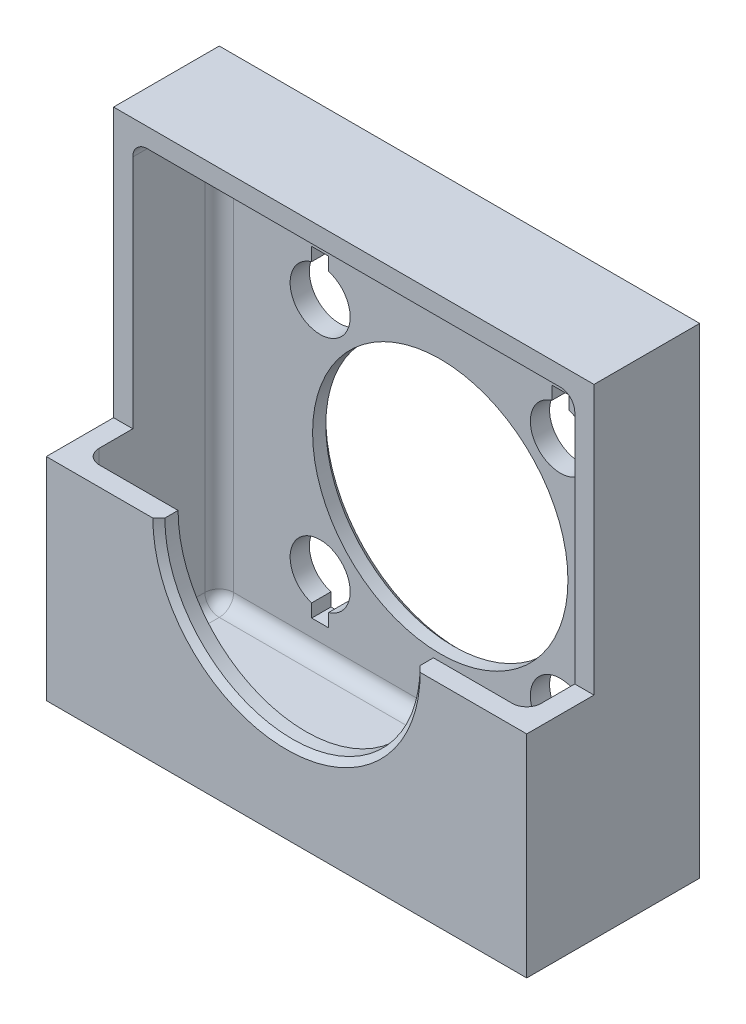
ISO-10303-21;
HEADER;
FILE_DESCRIPTION(('STEP AP214'),'2;1');
FILE_NAME('part.step','',(''),(''),'','','');
FILE_SCHEMA(('AUTOMOTIVE_DESIGN { 1 0 10303 214 1 1 1 1 }'));
ENDSEC;
DATA;
#1=APPLICATION_CONTEXT('core data for automotive mechanical design processes');
#2=APPLICATION_PROTOCOL_DEFINITION('international standard','automotive_design',2000,#1);
#3=PRODUCT_CONTEXT('',#1,'mechanical');
#4=PRODUCT('Part','Part','',(#3));
#5=PRODUCT_RELATED_PRODUCT_CATEGORY('part','',(#4));
#6=PRODUCT_DEFINITION_FORMATION('','',#4);
#7=PRODUCT_DEFINITION_CONTEXT('part definition',#1,'design');
#8=PRODUCT_DEFINITION('design','',#6,#7);
#9=PRODUCT_DEFINITION_SHAPE('','',#8);
#10=(LENGTH_UNIT() NAMED_UNIT(*) SI_UNIT(.MILLI.,.METRE.));
#11=(NAMED_UNIT(*) PLANE_ANGLE_UNIT() SI_UNIT($,.RADIAN.));
#12=(NAMED_UNIT(*) SI_UNIT($,.STERADIAN.) SOLID_ANGLE_UNIT());
#13=UNCERTAINTY_MEASURE_WITH_UNIT(LENGTH_MEASURE(1.E-05),#10,'distance_accuracy_value','');
#14=(GEOMETRIC_REPRESENTATION_CONTEXT(3) GLOBAL_UNCERTAINTY_ASSIGNED_CONTEXT((#13)) GLOBAL_UNIT_ASSIGNED_CONTEXT((#10,
#11,#12)) REPRESENTATION_CONTEXT('',''));
#15=CARTESIAN_POINT('',(0.,0.,0.));
#16=DIRECTION('',(0.,0.,1.));
#17=DIRECTION('',(1.,0.,0.));
#18=AXIS2_PLACEMENT_3D('',#15,#16,#17);
#19=CARTESIAN_POINT('',(0.,22.352,11.176));
#20=DIRECTION('',(0.,1.,0.));
#21=DIRECTION('',(0.,0.,1.));
#22=AXIS2_PLACEMENT_3D('',#19,#20,#21);
#23=PLANE('',#22);
#24=DIRECTION('',(0.,0.,-1.));
#25=VECTOR('',#24,1.);
#26=CARTESIAN_POINT('',(38.9001,22.352,18.288));
#27=LINE('',#26,#25);
#28=CARTESIAN_POINT('',(38.9001,22.352,16.256));
#29=VERTEX_POINT('',#28);
#30=CARTESIAN_POINT('',(38.9001,22.352,17.653));
#31=VERTEX_POINT('',#30);
#32=EDGE_CURVE('E416',#29,#31,#27,.F.);
#33=ORIENTED_EDGE('',*,*,#32,.T.);
#34=DIRECTION('',(-0.707106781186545,0.,-0.70710678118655));
#35=VECTOR('',#34,1.);
#36=CARTESIAN_POINT('',(25.4,22.352,4.15289999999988));
#37=LINE('',#36,#35);
#38=CARTESIAN_POINT('',(39.5351,22.352,18.288));
#39=VERTEX_POINT('',#38);
#40=EDGE_CURVE('E599',#31,#39,#37,.F.);
#41=ORIENTED_EDGE('',*,*,#40,.T.);
#42=DIRECTION('',(1.,0.,0.));
#43=VECTOR('',#42,1.);
#44=CARTESIAN_POINT('',(0.,22.352,18.288));
#45=LINE('',#44,#43);
#46=CARTESIAN_POINT('',(50.8,22.352,18.288));
#47=VERTEX_POINT('',#46);
#48=EDGE_CURVE('E450',#39,#47,#45,.T.);
#49=ORIENTED_EDGE('',*,*,#48,.T.);
#50=DIRECTION('',(0.,0.,1.));
#51=VECTOR('',#50,1.);
#52=CARTESIAN_POINT('',(50.8,22.352,11.176));
#53=LINE('',#52,#51);
#54=CARTESIAN_POINT('',(50.8,22.352,11.176));
#55=VERTEX_POINT('',#54);
#56=EDGE_CURVE('E434',#55,#47,#53,.T.);
#57=ORIENTED_EDGE('',*,*,#56,.F.);
#58=DIRECTION('',(1.,0.,0.));
#59=VECTOR('',#58,1.);
#60=CARTESIAN_POINT('',(0.,22.352,11.176));
#61=LINE('',#60,#59);
#62=CARTESIAN_POINT('',(48.768,22.352,11.176));
#63=VERTEX_POINT('',#62);
#64=EDGE_CURVE('E456',#63,#55,#61,.T.);
#65=ORIENTED_EDGE('',*,*,#64,.F.);
#66=DIRECTION('',(0.,0.,1.));
#67=VECTOR('',#66,1.);
#68=CARTESIAN_POINT('',(48.768,22.352,18.288));
#69=LINE('',#68,#67);
#70=CARTESIAN_POINT('',(48.768,22.352,14.732));
#71=VERTEX_POINT('',#70);
#72=EDGE_CURVE('E423',#63,#71,#69,.T.);
#73=ORIENTED_EDGE('',*,*,#72,.T.);
#74=CARTESIAN_POINT('',(47.244,22.352,14.732));
#75=DIRECTION('',(0.,1.,0.));
#76=DIRECTION('',(0.,0.,1.));
#77=AXIS2_PLACEMENT_3D('',#74,#75,#76);
#78=CIRCLE('',#77,1.524);
#79=CARTESIAN_POINT('',(47.244,22.352,16.256));
#80=VERTEX_POINT('',#79);
#81=EDGE_CURVE('E511',#71,#80,#78,.F.);
#82=ORIENTED_EDGE('',*,*,#81,.T.);
#83=DIRECTION('',(1.,0.,0.));
#84=VECTOR('',#83,1.);
#85=CARTESIAN_POINT('',(0.,22.352,16.256));
#86=LINE('',#85,#84);
#87=EDGE_CURVE('E428',#29,#80,#86,.T.);
#88=ORIENTED_EDGE('',*,*,#87,.F.);
#89=EDGE_LOOP('',(#33,#41,#49,#57,#65,#73,#82,#88));
#90=FACE_BOUND('',#89,.T.);
#91=ADVANCED_FACE('F41',(#90),#23,.T.);
#92=CARTESIAN_POINT('',(0.,22.352,18.288));
#93=VERTEX_POINT('',#92);
#94=CARTESIAN_POINT('',(11.2649,22.352,18.288));
#95=VERTEX_POINT('',#94);
#96=EDGE_CURVE('E457',#93,#95,#45,.T.);
#97=ORIENTED_EDGE('',*,*,#96,.T.);
#98=DIRECTION('',(-0.707106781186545,0.,0.70710678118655));
#99=VECTOR('',#98,1.);
#100=CARTESIAN_POINT('',(25.4,22.352,4.15289999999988));
#101=LINE('',#100,#99);
#102=CARTESIAN_POINT('',(11.8999,22.352,17.653));
#103=VERTEX_POINT('',#102);
#104=EDGE_CURVE('E605',#95,#103,#101,.F.);
#105=ORIENTED_EDGE('',*,*,#104,.T.);
#106=DIRECTION('',(0.,0.,-1.));
#107=VECTOR('',#106,1.);
#108=CARTESIAN_POINT('',(11.8999,22.352,18.288));
#109=LINE('',#108,#107);
#110=CARTESIAN_POINT('',(11.8999,22.352,16.256));
#111=VERTEX_POINT('',#110);
#112=EDGE_CURVE('E414',#103,#111,#109,.T.);
#113=ORIENTED_EDGE('',*,*,#112,.T.);
#114=CARTESIAN_POINT('',(3.556,22.352,16.256));
#115=VERTEX_POINT('',#114);
#116=EDGE_CURVE('E422',#115,#111,#86,.T.);
#117=ORIENTED_EDGE('',*,*,#116,.F.);
#118=CARTESIAN_POINT('',(3.556,22.352,14.732));
#119=DIRECTION('',(0.,1.,0.));
#120=DIRECTION('',(0.,0.,1.));
#121=AXIS2_PLACEMENT_3D('',#118,#119,#120);
#122=CIRCLE('',#121,1.524);
#123=CARTESIAN_POINT('',(2.032,22.352,14.732));
#124=VERTEX_POINT('',#123);
#125=EDGE_CURVE('E519',#115,#124,#122,.F.);
#126=ORIENTED_EDGE('',*,*,#125,.T.);
#127=DIRECTION('',(0.,0.,1.));
#128=VECTOR('',#127,1.);
#129=CARTESIAN_POINT('',(2.032,22.352,11.176));
#130=LINE('',#129,#128);
#131=CARTESIAN_POINT('',(2.032,22.352,11.176));
#132=VERTEX_POINT('',#131);
#133=EDGE_CURVE('E435',#132,#124,#130,.T.);
#134=ORIENTED_EDGE('',*,*,#133,.F.);
#135=CARTESIAN_POINT('',(0.,22.352,11.176));
#136=VERTEX_POINT('',#135);
#137=EDGE_CURVE('E452',#136,#132,#61,.T.);
#138=ORIENTED_EDGE('',*,*,#137,.F.);
#139=DIRECTION('',(0.,0.,1.));
#140=VECTOR('',#139,1.);
#141=CARTESIAN_POINT('',(0.,22.352,11.176));
#142=LINE('',#141,#140);
#143=EDGE_CURVE('E441',#136,#93,#142,.T.);
#144=ORIENTED_EDGE('',*,*,#143,.T.);
#145=EDGE_LOOP('',(#97,#105,#113,#117,#126,#134,#138,#144));
#146=FACE_BOUND('',#145,.T.);
#147=ADVANCED_FACE('F651',(#146),#23,.T.);
#148=CARTESIAN_POINT('',(0.,50.8,18.288));
#149=DIRECTION('',(0.,0.,1.));
#150=DIRECTION('',(1.,0.,0.));
#151=AXIS2_PLACEMENT_3D('',#148,#149,#150);
#152=PLANE('',#151);
#153=ORIENTED_EDGE('',*,*,#48,.F.);
#154=CARTESIAN_POINT('',(25.4,22.352,18.288));
#155=DIRECTION('',(0.,0.,1.));
#156=DIRECTION('',(1.,0.,0.));
#157=AXIS2_PLACEMENT_3D('',#154,#155,#156);
#158=CIRCLE('',#157,14.1351);
#159=EDGE_CURVE('E604',#39,#95,#158,.F.);
#160=ORIENTED_EDGE('',*,*,#159,.T.);
#161=ORIENTED_EDGE('',*,*,#96,.F.);
#162=DIRECTION('',(0.,1.,0.));
#163=VECTOR('',#162,1.);
#164=CARTESIAN_POINT('',(0.,0.,18.288));
#165=LINE('',#164,#163);
#166=CARTESIAN_POINT('',(0.,0.,18.288));
#167=VERTEX_POINT('',#166);
#168=EDGE_CURVE('E465',#167,#93,#165,.T.);
#169=ORIENTED_EDGE('',*,*,#168,.F.);
#170=DIRECTION('',(1.,0.,0.));
#171=VECTOR('',#170,1.);
#172=CARTESIAN_POINT('',(0.,0.,18.288));
#173=LINE('',#172,#171);
#174=CARTESIAN_POINT('',(50.8,0.,18.288));
#175=VERTEX_POINT('',#174);
#176=EDGE_CURVE('E466',#167,#175,#173,.T.);
#177=ORIENTED_EDGE('',*,*,#176,.T.);
#178=DIRECTION('',(0.,-1.,0.));
#179=VECTOR('',#178,1.);
#180=CARTESIAN_POINT('',(50.8,50.8,18.288));
#181=LINE('',#180,#179);
#182=EDGE_CURVE('E464',#47,#175,#181,.T.);
#183=ORIENTED_EDGE('',*,*,#182,.F.);
#184=EDGE_LOOP('',(#153,#160,#161,#169,#177,#183));
#185=FACE_BOUND('',#184,.T.);
#186=ADVANCED_FACE('F659',(#185),#152,.T.);
#187=CARTESIAN_POINT('',(0.,50.8,0.));
#188=DIRECTION('',(0.,0.,1.));
#189=DIRECTION('',(1.,0.,0.));
#190=AXIS2_PLACEMENT_3D('',#187,#188,#189);
#191=PLANE('',#190);
#192=DIRECTION('',(0.,1.,0.));
#193=VECTOR('',#192,1.);
#194=CARTESIAN_POINT('',(38.989,5.33400000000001,5.6843418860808E-11));
#195=LINE('',#194,#193);
#196=CARTESIAN_POINT('',(38.989,5.33400000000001,5.6843418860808E-11));
#197=VERTEX_POINT('',#196);
#198=CARTESIAN_POINT('',(38.989,6.73100000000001,0.));
#199=VERTEX_POINT('',#198);
#200=EDGE_CURVE('E291',#197,#199,#195,.T.);
#201=ORIENTED_EDGE('',*,*,#200,.T.);
#202=CARTESIAN_POINT('',(38.1,9.77900000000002,5.6843418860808E-11));
#203=DIRECTION('',(0.,0.,-1.));
#204=DIRECTION('',(1.,0.,0.));
#205=AXIS2_PLACEMENT_3D('',#202,#203,#204);
#206=CIRCLE('',#205,3.175);
#207=CARTESIAN_POINT('',(37.211,6.73100000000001,5.6843418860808E-11));
#208=VERTEX_POINT('',#207);
#209=EDGE_CURVE('E57',#208,#199,#206,.T.);
#210=ORIENTED_EDGE('',*,*,#209,.F.);
#211=DIRECTION('',(0.,-1.,0.));
#212=VECTOR('',#211,1.);
#213=CARTESIAN_POINT('',(37.211,6.73100000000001,5.6843418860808E-11));
#214=LINE('',#213,#212);
#215=CARTESIAN_POINT('',(37.211,5.33400000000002,5.6843418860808E-11));
#216=VERTEX_POINT('',#215);
#217=EDGE_CURVE('E307',#208,#216,#214,.T.);
#218=ORIENTED_EDGE('',*,*,#217,.T.);
#219=DIRECTION('',(-1.,0.,0.));
#220=VECTOR('',#219,1.);
#221=CARTESIAN_POINT('',(38.989,5.33400000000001,5.6843418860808E-11));
#222=LINE('',#221,#220);
#223=EDGE_CURVE('E303',#197,#216,#222,.T.);
#224=ORIENTED_EDGE('',*,*,#223,.F.);
#225=EDGE_LOOP('',(#201,#210,#218,#224));
#226=FACE_BOUND('',#225,.T.);
#227=DIRECTION('',(0.,-1.,0.));
#228=VECTOR('',#227,1.);
#229=CARTESIAN_POINT('',(13.589,6.73100000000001,5.6843418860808E-11));
#230=LINE('',#229,#228);
#231=CARTESIAN_POINT('',(13.589,6.73100000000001,5.6843418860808E-11));
#232=VERTEX_POINT('',#231);
#233=CARTESIAN_POINT('',(13.589,5.33400000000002,5.6843418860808E-11));
#234=VERTEX_POINT('',#233);
#235=EDGE_CURVE('E343',#232,#234,#230,.T.);
#236=ORIENTED_EDGE('',*,*,#235,.F.);
#237=CARTESIAN_POINT('',(12.7,9.77900000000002,5.6843418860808E-11));
#238=DIRECTION('',(0.,0.,1.));
#239=DIRECTION('',(-1.,0.,0.));
#240=AXIS2_PLACEMENT_3D('',#237,#238,#239);
#241=CIRCLE('',#240,3.175);
#242=CARTESIAN_POINT('',(11.811,6.73100000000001,0.));
#243=VERTEX_POINT('',#242);
#244=EDGE_CURVE('E354',#232,#243,#241,.T.);
#245=ORIENTED_EDGE('',*,*,#244,.T.);
#246=DIRECTION('',(0.,1.,0.));
#247=VECTOR('',#246,1.);
#248=CARTESIAN_POINT('',(11.811,5.33400000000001,5.6843418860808E-11));
#249=LINE('',#248,#247);
#250=CARTESIAN_POINT('',(11.811,5.33400000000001,0.));
#251=VERTEX_POINT('',#250);
#252=EDGE_CURVE('E322',#251,#243,#249,.T.);
#253=ORIENTED_EDGE('',*,*,#252,.F.);
#254=DIRECTION('',(1.,0.,0.));
#255=VECTOR('',#254,1.);
#256=CARTESIAN_POINT('',(11.811,5.33400000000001,5.6843418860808E-11));
#257=LINE('',#256,#255);
#258=EDGE_CURVE('E339',#251,#234,#257,.T.);
#259=ORIENTED_EDGE('',*,*,#258,.T.);
#260=EDGE_LOOP('',(#236,#245,#253,#259));
#261=FACE_BOUND('',#260,.T.);
#262=DIRECTION('',(0.,1.,0.));
#263=VECTOR('',#262,1.);
#264=CARTESIAN_POINT('',(37.211,37.973,5.6843418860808E-11));
#265=LINE('',#264,#263);
#266=CARTESIAN_POINT('',(37.211,37.973,5.6843418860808E-11));
#267=VERTEX_POINT('',#266);
#268=CARTESIAN_POINT('',(37.211,39.37,5.6843418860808E-11));
#269=VERTEX_POINT('',#268);
#270=EDGE_CURVE('E380',#267,#269,#265,.T.);
#271=ORIENTED_EDGE('',*,*,#270,.F.);
#272=CARTESIAN_POINT('',(38.1,34.925,5.6843418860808E-11));
#273=DIRECTION('',(0.,0.,1.));
#274=DIRECTION('',(1.,0.,0.));
#275=AXIS2_PLACEMENT_3D('',#272,#273,#274);
#276=CIRCLE('',#275,3.175);
#277=CARTESIAN_POINT('',(38.989,37.973,0.));
#278=VERTEX_POINT('',#277);
#279=EDGE_CURVE('E390',#267,#278,#276,.T.);
#280=ORIENTED_EDGE('',*,*,#279,.T.);
#281=DIRECTION('',(0.,-1.,0.));
#282=VECTOR('',#281,1.);
#283=CARTESIAN_POINT('',(38.989,39.37,5.6843418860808E-11));
#284=LINE('',#283,#282);
#285=CARTESIAN_POINT('',(38.989,39.37,0.));
#286=VERTEX_POINT('',#285);
#287=EDGE_CURVE('E356',#286,#278,#284,.T.);
#288=ORIENTED_EDGE('',*,*,#287,.F.);
#289=DIRECTION('',(-1.,0.,0.));
#290=VECTOR('',#289,1.);
#291=CARTESIAN_POINT('',(38.989,39.37,5.6843418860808E-11));
#292=LINE('',#291,#290);
#293=EDGE_CURVE('E375',#286,#269,#292,.T.);
#294=ORIENTED_EDGE('',*,*,#293,.T.);
#295=EDGE_LOOP('',(#271,#280,#288,#294));
#296=FACE_BOUND('',#295,.T.);
#297=DIRECTION('',(0.,-1.,0.));
#298=VECTOR('',#297,1.);
#299=CARTESIAN_POINT('',(11.811,39.37,5.6843418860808E-11));
#300=LINE('',#299,#298);
#301=CARTESIAN_POINT('',(11.811,39.37,5.6843418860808E-11));
#302=VERTEX_POINT('',#301);
#303=CARTESIAN_POINT('',(11.811,37.973,0.));
#304=VERTEX_POINT('',#303);
#305=EDGE_CURVE('E391',#302,#304,#300,.T.);
#306=ORIENTED_EDGE('',*,*,#305,.T.);
#307=CARTESIAN_POINT('',(12.7,34.925,5.6843418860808E-11));
#308=DIRECTION('',(0.,0.,-1.));
#309=DIRECTION('',(-1.,0.,0.));
#310=AXIS2_PLACEMENT_3D('',#307,#308,#309);
#311=CIRCLE('',#310,3.175);
#312=CARTESIAN_POINT('',(13.589,37.973,5.6843418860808E-11));
#313=VERTEX_POINT('',#312);
#314=EDGE_CURVE('E393',#313,#304,#311,.T.);
#315=ORIENTED_EDGE('',*,*,#314,.F.);
#316=DIRECTION('',(0.,1.,0.));
#317=VECTOR('',#316,1.);
#318=CARTESIAN_POINT('',(13.589,37.973,5.6843418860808E-11));
#319=LINE('',#318,#317);
#320=CARTESIAN_POINT('',(13.589,39.37,5.6843418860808E-11));
#321=VERTEX_POINT('',#320);
#322=EDGE_CURVE('E397',#313,#321,#319,.T.);
#323=ORIENTED_EDGE('',*,*,#322,.T.);
#324=DIRECTION('',(1.,0.,0.));
#325=VECTOR('',#324,1.);
#326=CARTESIAN_POINT('',(11.811,39.37,5.6843418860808E-11));
#327=LINE('',#326,#325);
#328=EDGE_CURVE('E398',#302,#321,#327,.T.);
#329=ORIENTED_EDGE('',*,*,#328,.F.);
#330=EDGE_LOOP('',(#306,#315,#323,#329));
#331=FACE_BOUND('',#330,.T.);
#332=CARTESIAN_POINT('',(25.4,22.352,0.));
#333=DIRECTION('',(0.,0.,1.));
#334=DIRECTION('',(1.,0.,0.));
#335=AXIS2_PLACEMENT_3D('',#332,#333,#334);
#336=CIRCLE('',#335,14.1351);
#337=CARTESIAN_POINT('',(39.5351,22.352,0.));
#338=VERTEX_POINT('',#337);
#339=EDGE_CURVE('E602',#338,#338,#336,.T.);
#340=ORIENTED_EDGE('',*,*,#339,.T.);
#341=EDGE_LOOP('',(#340));
#342=FACE_BOUND('',#341,.T.);
#343=DIRECTION('',(0.,1.,0.));
#344=VECTOR('',#343,1.);
#345=CARTESIAN_POINT('',(0.,0.,0.));
#346=LINE('',#345,#344);
#347=CARTESIAN_POINT('',(0.,0.,0.));
#348=VERTEX_POINT('',#347);
#349=CARTESIAN_POINT('',(0.,50.8,0.));
#350=VERTEX_POINT('',#349);
#351=EDGE_CURVE('E453',#348,#350,#346,.T.);
#352=ORIENTED_EDGE('',*,*,#351,.T.);
#353=DIRECTION('',(-1.,0.,0.));
#354=VECTOR('',#353,1.);
#355=CARTESIAN_POINT('',(50.8,50.8,0.));
#356=LINE('',#355,#354);
#357=CARTESIAN_POINT('',(50.8,50.8,0.));
#358=VERTEX_POINT('',#357);
#359=EDGE_CURVE('E473',#358,#350,#356,.T.);
#360=ORIENTED_EDGE('',*,*,#359,.F.);
#361=DIRECTION('',(0.,-1.,0.));
#362=VECTOR('',#361,1.);
#363=CARTESIAN_POINT('',(50.8,50.8,0.));
#364=LINE('',#363,#362);
#365=CARTESIAN_POINT('',(50.8,0.,0.));
#366=VERTEX_POINT('',#365);
#367=EDGE_CURVE('E480',#358,#366,#364,.T.);
#368=ORIENTED_EDGE('',*,*,#367,.T.);
#369=DIRECTION('',(1.,0.,0.));
#370=VECTOR('',#369,1.);
#371=CARTESIAN_POINT('',(0.,0.,0.));
#372=LINE('',#371,#370);
#373=EDGE_CURVE('E467',#348,#366,#372,.T.);
#374=ORIENTED_EDGE('',*,*,#373,.F.);
#375=EDGE_LOOP('',(#352,#360,#368,#374));
#376=FACE_BOUND('',#375,.T.);
#377=ADVANCED_FACE('F310',(#226,#261,#296,#331,#342,#376),#191,.F.);
#378=CARTESIAN_POINT('',(0.,50.8,16.256));
#379=DIRECTION('',(0.,0.,1.));
#380=DIRECTION('',(1.,0.,0.));
#381=AXIS2_PLACEMENT_3D('',#378,#379,#380);
#382=PLANE('',#381);
#383=DIRECTION('',(0.,-1.,0.));
#384=VECTOR('',#383,1.);
#385=CARTESIAN_POINT('',(47.244,2.032,16.256));
#386=LINE('',#385,#384);
#387=CARTESIAN_POINT('',(47.244,3.556,16.256));
#388=VERTEX_POINT('',#387);
#389=EDGE_CURVE('E494',#80,#388,#386,.T.);
#390=ORIENTED_EDGE('',*,*,#389,.T.);
#391=DIRECTION('',(1.,0.,0.));
#392=VECTOR('',#391,1.);
#393=CARTESIAN_POINT('',(0.,3.556,16.256));
#394=LINE('',#393,#392);
#395=CARTESIAN_POINT('',(3.556,3.556,16.256));
#396=VERTEX_POINT('',#395);
#397=EDGE_CURVE('E559',#388,#396,#394,.F.);
#398=ORIENTED_EDGE('',*,*,#397,.T.);
#399=DIRECTION('',(0.,1.,0.));
#400=VECTOR('',#399,1.);
#401=CARTESIAN_POINT('',(3.556,22.352,16.256));
#402=LINE('',#401,#400);
#403=EDGE_CURVE('E482',#396,#115,#402,.T.);
#404=ORIENTED_EDGE('',*,*,#403,.T.);
#405=ORIENTED_EDGE('',*,*,#116,.T.);
#406=CARTESIAN_POINT('',(25.4,22.352,16.256));
#407=DIRECTION('',(0.,0.,1.));
#408=DIRECTION('',(1.,0.,0.));
#409=AXIS2_PLACEMENT_3D('',#406,#407,#408);
#410=CIRCLE('',#409,13.5001);
#411=EDGE_CURVE('E415',#29,#111,#410,.F.);
#412=ORIENTED_EDGE('',*,*,#411,.F.);
#413=ORIENTED_EDGE('',*,*,#87,.T.);
#414=EDGE_LOOP('',(#390,#398,#404,#405,#412,#413));
#415=FACE_BOUND('',#414,.T.);
#416=ADVANCED_FACE('F667',(#415),#382,.F.);
#417=CARTESIAN_POINT('',(0.,50.8,2.032));
#418=DIRECTION('',(0.,0.,1.));
#419=DIRECTION('',(1.,0.,0.));
#420=AXIS2_PLACEMENT_3D('',#417,#418,#419);
#421=PLANE('',#420);
#422=CARTESIAN_POINT('',(38.1,9.77900000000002,2.032));
#423=DIRECTION('',(0.,0.,1.));
#424=DIRECTION('',(-1.,0.,0.));
#425=AXIS2_PLACEMENT_3D('',#422,#423,#424);
#426=CIRCLE('',#425,3.175);
#427=CARTESIAN_POINT('',(38.989,6.73100000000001,2.032));
#428=VERTEX_POINT('',#427);
#429=CARTESIAN_POINT('',(37.211,6.73100000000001,2.032));
#430=VERTEX_POINT('',#429);
#431=EDGE_CURVE('E324',#428,#430,#426,.T.);
#432=ORIENTED_EDGE('',*,*,#431,.F.);
#433=DIRECTION('',(0.,-1.,0.));
#434=VECTOR('',#433,1.);
#435=CARTESIAN_POINT('',(38.989,-6.09599999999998,2.032));
#436=LINE('',#435,#434);
#437=CARTESIAN_POINT('',(38.989,5.33400000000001,2.032));
#438=VERTEX_POINT('',#437);
#439=EDGE_CURVE('E297',#428,#438,#436,.T.);
#440=ORIENTED_EDGE('',*,*,#439,.T.);
#441=DIRECTION('',(1.,0.,0.));
#442=VECTOR('',#441,1.);
#443=CARTESIAN_POINT('',(50.8,5.33399999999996,2.032));
#444=LINE('',#443,#442);
#445=CARTESIAN_POINT('',(37.211,5.33400000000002,2.032));
#446=VERTEX_POINT('',#445);
#447=EDGE_CURVE('E63',#446,#438,#444,.T.);
#448=ORIENTED_EDGE('',*,*,#447,.F.);
#449=DIRECTION('',(0.,1.,0.));
#450=VECTOR('',#449,1.);
#451=CARTESIAN_POINT('',(37.211,-6.09599999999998,2.032));
#452=LINE('',#451,#450);
#453=EDGE_CURVE('E319',#446,#430,#452,.T.);
#454=ORIENTED_EDGE('',*,*,#453,.T.);
#455=EDGE_LOOP('',(#432,#440,#448,#454));
#456=FACE_BOUND('',#455,.T.);
#457=CARTESIAN_POINT('',(12.7,9.77900000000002,2.032));
#458=DIRECTION('',(0.,0.,-1.));
#459=DIRECTION('',(1.,0.,0.));
#460=AXIS2_PLACEMENT_3D('',#457,#458,#459);
#461=CIRCLE('',#460,3.175);
#462=CARTESIAN_POINT('',(11.811,6.73100000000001,2.032));
#463=VERTEX_POINT('',#462);
#464=CARTESIAN_POINT('',(13.589,6.73100000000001,2.032));
#465=VERTEX_POINT('',#464);
#466=EDGE_CURVE('E355',#463,#465,#461,.T.);
#467=ORIENTED_EDGE('',*,*,#466,.T.);
#468=DIRECTION('',(0.,1.,0.));
#469=VECTOR('',#468,1.);
#470=CARTESIAN_POINT('',(13.589,-6.09599999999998,2.032));
#471=LINE('',#470,#469);
#472=CARTESIAN_POINT('',(13.589,5.33400000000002,2.032));
#473=VERTEX_POINT('',#472);
#474=EDGE_CURVE('E347',#473,#465,#471,.T.);
#475=ORIENTED_EDGE('',*,*,#474,.F.);
#476=DIRECTION('',(-1.,0.,0.));
#477=VECTOR('',#476,1.);
#478=CARTESIAN_POINT('',(0.,5.33399999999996,2.032));
#479=LINE('',#478,#477);
#480=CARTESIAN_POINT('',(11.811,5.33400000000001,2.032));
#481=VERTEX_POINT('',#480);
#482=EDGE_CURVE('E337',#473,#481,#479,.T.);
#483=ORIENTED_EDGE('',*,*,#482,.T.);
#484=DIRECTION('',(0.,-1.,0.));
#485=VECTOR('',#484,1.);
#486=CARTESIAN_POINT('',(11.811,-6.09599999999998,2.032));
#487=LINE('',#486,#485);
#488=EDGE_CURVE('E326',#463,#481,#487,.T.);
#489=ORIENTED_EDGE('',*,*,#488,.F.);
#490=EDGE_LOOP('',(#467,#475,#483,#489));
#491=FACE_BOUND('',#490,.T.);
#492=CARTESIAN_POINT('',(38.1,34.925,2.032));
#493=DIRECTION('',(0.,0.,-1.));
#494=DIRECTION('',(-1.,0.,0.));
#495=AXIS2_PLACEMENT_3D('',#492,#493,#494);
#496=CIRCLE('',#495,3.175);
#497=CARTESIAN_POINT('',(38.989,37.973,2.032));
#498=VERTEX_POINT('',#497);
#499=CARTESIAN_POINT('',(37.211,37.973,2.032));
#500=VERTEX_POINT('',#499);
#501=EDGE_CURVE('E383',#498,#500,#496,.T.);
#502=ORIENTED_EDGE('',*,*,#501,.T.);
#503=DIRECTION('',(0.,-1.,0.));
#504=VECTOR('',#503,1.);
#505=CARTESIAN_POINT('',(37.211,50.8,2.032));
#506=LINE('',#505,#504);
#507=CARTESIAN_POINT('',(37.211,39.37,2.032));
#508=VERTEX_POINT('',#507);
#509=EDGE_CURVE('E385',#508,#500,#506,.T.);
#510=ORIENTED_EDGE('',*,*,#509,.F.);
#511=DIRECTION('',(1.,0.,0.));
#512=VECTOR('',#511,1.);
#513=CARTESIAN_POINT('',(50.8,39.3700000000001,2.032));
#514=LINE('',#513,#512);
#515=CARTESIAN_POINT('',(38.989,39.37,2.032));
#516=VERTEX_POINT('',#515);
#517=EDGE_CURVE('E367',#508,#516,#514,.T.);
#518=ORIENTED_EDGE('',*,*,#517,.T.);
#519=DIRECTION('',(0.,1.,0.));
#520=VECTOR('',#519,1.);
#521=CARTESIAN_POINT('',(38.989,50.8,2.032));
#522=LINE('',#521,#520);
#523=EDGE_CURVE('E363',#498,#516,#522,.T.);
#524=ORIENTED_EDGE('',*,*,#523,.F.);
#525=EDGE_LOOP('',(#502,#510,#518,#524));
#526=FACE_BOUND('',#525,.T.);
#527=CARTESIAN_POINT('',(12.7,34.925,2.032));
#528=DIRECTION('',(0.,0.,1.));
#529=DIRECTION('',(1.,0.,0.));
#530=AXIS2_PLACEMENT_3D('',#527,#528,#529);
#531=CIRCLE('',#530,3.175);
#532=CARTESIAN_POINT('',(11.811,37.973,2.032));
#533=VERTEX_POINT('',#532);
#534=CARTESIAN_POINT('',(13.589,37.973,2.032));
#535=VERTEX_POINT('',#534);
#536=EDGE_CURVE('E11',#533,#535,#531,.T.);
#537=ORIENTED_EDGE('',*,*,#536,.F.);
#538=DIRECTION('',(0.,1.,0.));
#539=VECTOR('',#538,1.);
#540=CARTESIAN_POINT('',(11.811,50.8,2.032));
#541=LINE('',#540,#539);
#542=CARTESIAN_POINT('',(11.811,39.37,2.032));
#543=VERTEX_POINT('',#542);
#544=EDGE_CURVE('E613',#533,#543,#541,.T.);
#545=ORIENTED_EDGE('',*,*,#544,.T.);
#546=DIRECTION('',(-1.,0.,0.));
#547=VECTOR('',#546,1.);
#548=CARTESIAN_POINT('',(0.,39.3700000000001,2.032));
#549=LINE('',#548,#547);
#550=CARTESIAN_POINT('',(13.589,39.37,2.032));
#551=VERTEX_POINT('',#550);
#552=EDGE_CURVE('E612',#551,#543,#549,.T.);
#553=ORIENTED_EDGE('',*,*,#552,.F.);
#554=DIRECTION('',(0.,-1.,0.));
#555=VECTOR('',#554,1.);
#556=CARTESIAN_POINT('',(13.589,50.8,2.032));
#557=LINE('',#556,#555);
#558=EDGE_CURVE('E47',#551,#535,#557,.T.);
#559=ORIENTED_EDGE('',*,*,#558,.T.);
#560=EDGE_LOOP('',(#537,#545,#553,#559));
#561=FACE_BOUND('',#560,.T.);
#562=DIRECTION('',(0.,1.,0.));
#563=VECTOR('',#562,1.);
#564=CARTESIAN_POINT('',(3.55600000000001,50.8,2.032));
#565=LINE('',#564,#563);
#566=CARTESIAN_POINT('',(3.55600000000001,47.244,2.032));
#567=VERTEX_POINT('',#566);
#568=CARTESIAN_POINT('',(3.556,3.556,2.032));
#569=VERTEX_POINT('',#568);
#570=EDGE_CURVE('E505',#567,#569,#565,.F.);
#571=ORIENTED_EDGE('',*,*,#570,.T.);
#572=DIRECTION('',(1.,0.,0.));
#573=VECTOR('',#572,1.);
#574=CARTESIAN_POINT('',(47.244,3.556,2.032));
#575=LINE('',#574,#573);
#576=CARTESIAN_POINT('',(47.244,3.556,2.032));
#577=VERTEX_POINT('',#576);
#578=EDGE_CURVE('E517',#569,#577,#575,.T.);
#579=ORIENTED_EDGE('',*,*,#578,.T.);
#580=DIRECTION('',(0.,-1.,0.));
#581=VECTOR('',#580,1.);
#582=CARTESIAN_POINT('',(47.244,50.8,2.032));
#583=LINE('',#582,#581);
#584=CARTESIAN_POINT('',(47.244,47.244,2.032));
#585=VERTEX_POINT('',#584);
#586=EDGE_CURVE('E504',#577,#585,#583,.F.);
#587=ORIENTED_EDGE('',*,*,#586,.T.);
#588=DIRECTION('',(-1.,0.,0.));
#589=VECTOR('',#588,1.);
#590=CARTESIAN_POINT('',(3.55600000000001,47.244,2.032));
#591=LINE('',#590,#589);
#592=EDGE_CURVE('E520',#585,#567,#591,.T.);
#593=ORIENTED_EDGE('',*,*,#592,.T.);
#594=EDGE_LOOP('',(#571,#579,#587,#593));
#595=FACE_BOUND('',#594,.T.);
#596=CARTESIAN_POINT('',(25.4,22.352,2.032));
#597=DIRECTION('',(0.,0.,1.));
#598=DIRECTION('',(1.,0.,0.));
#599=AXIS2_PLACEMENT_3D('',#596,#597,#598);
#600=CIRCLE('',#599,13.5001);
#601=CARTESIAN_POINT('',(38.9001,22.352,2.032));
#602=VERTEX_POINT('',#601);
#603=EDGE_CURVE('E418',#602,#602,#600,.F.);
#604=ORIENTED_EDGE('',*,*,#603,.T.);
#605=EDGE_LOOP('',(#604));
#606=FACE_BOUND('',#605,.T.);
#607=ADVANCED_FACE('F619',(#456,#491,#526,#561,#595,#606),#421,.T.);
#608=CARTESIAN_POINT('',(0.,22.352,11.176));
#609=DIRECTION('',(0.,0.,-1.));
#610=DIRECTION('',(-1.,0.,0.));
#611=AXIS2_PLACEMENT_3D('',#608,#609,#610);
#612=PLANE('',#611);
#613=DIRECTION('',(0.,1.,0.));
#614=VECTOR('',#613,1.);
#615=CARTESIAN_POINT('',(48.768,50.8,11.176));
#616=LINE('',#615,#614);
#617=CARTESIAN_POINT('',(48.768,47.244,11.176));
#618=VERTEX_POINT('',#617);
#619=EDGE_CURVE('E429',#63,#618,#616,.T.);
#620=ORIENTED_EDGE('',*,*,#619,.F.);
#621=ORIENTED_EDGE('',*,*,#64,.T.);
#622=DIRECTION('',(0.,1.,0.));
#623=VECTOR('',#622,1.);
#624=CARTESIAN_POINT('',(50.8,22.352,11.176));
#625=LINE('',#624,#623);
#626=CARTESIAN_POINT('',(50.8,50.8,11.176));
#627=VERTEX_POINT('',#626);
#628=EDGE_CURVE('E443',#55,#627,#625,.T.);
#629=ORIENTED_EDGE('',*,*,#628,.T.);
#630=DIRECTION('',(1.,0.,0.));
#631=VECTOR('',#630,1.);
#632=CARTESIAN_POINT('',(0.,50.8,11.176));
#633=LINE('',#632,#631);
#634=CARTESIAN_POINT('',(0.,50.8,11.176));
#635=VERTEX_POINT('',#634);
#636=EDGE_CURVE('E454',#635,#627,#633,.T.);
#637=ORIENTED_EDGE('',*,*,#636,.F.);
#638=DIRECTION('',(0.,1.,0.));
#639=VECTOR('',#638,1.);
#640=CARTESIAN_POINT('',(0.,22.352,11.176));
#641=LINE('',#640,#639);
#642=EDGE_CURVE('E442',#136,#635,#641,.T.);
#643=ORIENTED_EDGE('',*,*,#642,.F.);
#644=ORIENTED_EDGE('',*,*,#137,.T.);
#645=DIRECTION('',(0.,1.,0.));
#646=VECTOR('',#645,1.);
#647=CARTESIAN_POINT('',(2.032,22.352,11.176));
#648=LINE('',#647,#646);
#649=CARTESIAN_POINT('',(2.03200000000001,47.244,11.176));
#650=VERTEX_POINT('',#649);
#651=EDGE_CURVE('E436',#132,#650,#648,.T.);
#652=ORIENTED_EDGE('',*,*,#651,.T.);
#653=CARTESIAN_POINT('',(3.55600000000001,47.244,11.176));
#654=DIRECTION('',(0.,0.,-1.));
#655=DIRECTION('',(-1.,0.,0.));
#656=AXIS2_PLACEMENT_3D('',#653,#654,#655);
#657=CIRCLE('',#656,1.524);
#658=CARTESIAN_POINT('',(3.55600000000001,48.768,11.176));
#659=VERTEX_POINT('',#658);
#660=EDGE_CURVE('E563',#650,#659,#657,.T.);
#661=ORIENTED_EDGE('',*,*,#660,.T.);
#662=DIRECTION('',(1.,0.,0.));
#663=VECTOR('',#662,1.);
#664=CARTESIAN_POINT('',(50.8,48.768,11.176));
#665=LINE('',#664,#663);
#666=CARTESIAN_POINT('',(47.244,48.768,11.176));
#667=VERTEX_POINT('',#666);
#668=EDGE_CURVE('E424',#659,#667,#665,.T.);
#669=ORIENTED_EDGE('',*,*,#668,.T.);
#670=CARTESIAN_POINT('',(47.244,47.244,11.176));
#671=DIRECTION('',(0.,0.,-1.));
#672=DIRECTION('',(-1.,0.,0.));
#673=AXIS2_PLACEMENT_3D('',#670,#671,#672);
#674=CIRCLE('',#673,1.524);
#675=EDGE_CURVE('E561',#667,#618,#674,.T.);
#676=ORIENTED_EDGE('',*,*,#675,.T.);
#677=EDGE_LOOP('',(#620,#621,#629,#637,#643,#644,#652,#661,#669,#676));
#678=FACE_BOUND('',#677,.T.);
#679=ADVANCED_FACE('F664',(#678),#612,.F.);
#680=CARTESIAN_POINT('',(0.,0.,18.288));
#681=DIRECTION('',(-1.,0.,0.));
#682=DIRECTION('',(0.,-1.,0.));
#683=AXIS2_PLACEMENT_3D('',#680,#681,#682);
#684=PLANE('',#683);
#685=ORIENTED_EDGE('',*,*,#642,.T.);
#686=DIRECTION('',(0.,0.,-1.));
#687=VECTOR('',#686,1.);
#688=CARTESIAN_POINT('',(0.,50.8,18.288));
#689=LINE('',#688,#687);
#690=EDGE_CURVE('E474',#635,#350,#689,.T.);
#691=ORIENTED_EDGE('',*,*,#690,.T.);
#692=ORIENTED_EDGE('',*,*,#351,.F.);
#693=DIRECTION('',(0.,0.,-1.));
#694=VECTOR('',#693,1.);
#695=CARTESIAN_POINT('',(0.,0.,18.288));
#696=LINE('',#695,#694);
#697=EDGE_CURVE('E485',#167,#348,#696,.T.);
#698=ORIENTED_EDGE('',*,*,#697,.F.);
#699=ORIENTED_EDGE('',*,*,#168,.T.);
#700=ORIENTED_EDGE('',*,*,#143,.F.);
#701=EDGE_LOOP('',(#685,#691,#692,#698,#699,#700));
#702=FACE_BOUND('',#701,.T.);
#703=ADVANCED_FACE('F674',(#702),#684,.T.);
#704=CARTESIAN_POINT('',(0.,0.,18.288));
#705=DIRECTION('',(0.,1.,0.));
#706=DIRECTION('',(0.,0.,1.));
#707=AXIS2_PLACEMENT_3D('',#704,#705,#706);
#708=PLANE('',#707);
#709=ORIENTED_EDGE('',*,*,#373,.T.);
#710=DIRECTION('',(0.,0.,-1.));
#711=VECTOR('',#710,1.);
#712=CARTESIAN_POINT('',(50.8,0.,18.288));
#713=LINE('',#712,#711);
#714=EDGE_CURVE('E484',#175,#366,#713,.T.);
#715=ORIENTED_EDGE('',*,*,#714,.F.);
#716=ORIENTED_EDGE('',*,*,#176,.F.);
#717=ORIENTED_EDGE('',*,*,#697,.T.);
#718=EDGE_LOOP('',(#709,#715,#716,#717));
#719=FACE_BOUND('',#718,.T.);
#720=ADVANCED_FACE('F673',(#719),#708,.F.);
#721=CARTESIAN_POINT('',(50.8,50.8,18.288));
#722=DIRECTION('',(1.,0.,0.));
#723=DIRECTION('',(0.,1.,0.));
#724=AXIS2_PLACEMENT_3D('',#721,#722,#723);
#725=PLANE('',#724);
#726=ORIENTED_EDGE('',*,*,#628,.F.);
#727=ORIENTED_EDGE('',*,*,#56,.T.);
#728=ORIENTED_EDGE('',*,*,#182,.T.);
#729=ORIENTED_EDGE('',*,*,#714,.T.);
#730=ORIENTED_EDGE('',*,*,#367,.F.);
#731=DIRECTION('',(0.,0.,-1.));
#732=VECTOR('',#731,1.);
#733=CARTESIAN_POINT('',(50.8,50.8,18.288));
#734=LINE('',#733,#732);
#735=EDGE_CURVE('E487',#627,#358,#734,.T.);
#736=ORIENTED_EDGE('',*,*,#735,.F.);
#737=EDGE_LOOP('',(#726,#727,#728,#729,#730,#736));
#738=FACE_BOUND('',#737,.T.);
#739=ADVANCED_FACE('F672',(#738),#725,.T.);
#740=CARTESIAN_POINT('',(50.8,50.8,18.288));
#741=DIRECTION('',(0.,-1.,0.));
#742=DIRECTION('',(0.,0.,-1.));
#743=AXIS2_PLACEMENT_3D('',#740,#741,#742);
#744=PLANE('',#743);
#745=ORIENTED_EDGE('',*,*,#690,.F.);
#746=ORIENTED_EDGE('',*,*,#636,.T.);
#747=ORIENTED_EDGE('',*,*,#735,.T.);
#748=ORIENTED_EDGE('',*,*,#359,.T.);
#749=EDGE_LOOP('',(#745,#746,#747,#748));
#750=FACE_BOUND('',#749,.T.);
#751=ADVANCED_FACE('F677',(#750),#744,.F.);
#752=CARTESIAN_POINT('',(2.032,0.,18.288));
#753=DIRECTION('',(-1.,0.,0.));
#754=DIRECTION('',(0.,-1.,0.));
#755=AXIS2_PLACEMENT_3D('',#752,#753,#754);
#756=PLANE('',#755);
#757=DIRECTION('',(0.,1.,0.));
#758=VECTOR('',#757,1.);
#759=CARTESIAN_POINT('',(2.032,0.,3.556));
#760=LINE('',#759,#758);
#761=CARTESIAN_POINT('',(2.032,3.556,3.556));
#762=VERTEX_POINT('',#761);
#763=CARTESIAN_POINT('',(2.03200000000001,47.244,3.556));
#764=VERTEX_POINT('',#763);
#765=EDGE_CURVE('E512',#762,#764,#760,.T.);
#766=ORIENTED_EDGE('',*,*,#765,.T.);
#767=DIRECTION('',(0.,0.,-1.));
#768=VECTOR('',#767,1.);
#769=CARTESIAN_POINT('',(2.03200000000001,47.244,18.288));
#770=LINE('',#769,#768);
#771=EDGE_CURVE('E551',#764,#650,#770,.F.);
#772=ORIENTED_EDGE('',*,*,#771,.T.);
#773=ORIENTED_EDGE('',*,*,#651,.F.);
#774=ORIENTED_EDGE('',*,*,#133,.T.);
#775=DIRECTION('',(0.,1.,0.));
#776=VECTOR('',#775,1.);
#777=CARTESIAN_POINT('',(2.032,2.032,14.732));
#778=LINE('',#777,#776);
#779=CARTESIAN_POINT('',(2.032,3.556,14.732));
#780=VERTEX_POINT('',#779);
#781=EDGE_CURVE('E507',#124,#780,#778,.F.);
#782=ORIENTED_EDGE('',*,*,#781,.T.);
#783=DIRECTION('',(0.,0.,-1.));
#784=VECTOR('',#783,1.);
#785=CARTESIAN_POINT('',(2.032,3.556,18.288));
#786=LINE('',#785,#784);
#787=EDGE_CURVE('E553',#780,#762,#786,.T.);
#788=ORIENTED_EDGE('',*,*,#787,.T.);
#789=EDGE_LOOP('',(#766,#772,#773,#774,#782,#788));
#790=FACE_BOUND('',#789,.T.);
#791=ADVANCED_FACE('F681',(#790),#756,.F.);
#792=CARTESIAN_POINT('',(0.,2.032,18.288));
#793=DIRECTION('',(0.,1.,0.));
#794=DIRECTION('',(0.,0.,1.));
#795=AXIS2_PLACEMENT_3D('',#792,#793,#794);
#796=PLANE('',#795);
#797=DIRECTION('',(0.,0.,-1.));
#798=VECTOR('',#797,1.);
#799=CARTESIAN_POINT('',(47.244,2.032,18.288));
#800=LINE('',#799,#798);
#801=CARTESIAN_POINT('',(47.244,2.032,14.732));
#802=VERTEX_POINT('',#801);
#803=CARTESIAN_POINT('',(47.244,2.032,3.556));
#804=VERTEX_POINT('',#803);
#805=EDGE_CURVE('E524',#802,#804,#800,.T.);
#806=ORIENTED_EDGE('',*,*,#805,.T.);
#807=DIRECTION('',(1.,0.,0.));
#808=VECTOR('',#807,1.);
#809=CARTESIAN_POINT('',(3.556,2.032,3.556));
#810=LINE('',#809,#808);
#811=CARTESIAN_POINT('',(3.556,2.032,3.556));
#812=VERTEX_POINT('',#811);
#813=EDGE_CURVE('E527',#804,#812,#810,.F.);
#814=ORIENTED_EDGE('',*,*,#813,.T.);
#815=DIRECTION('',(0.,0.,-1.));
#816=VECTOR('',#815,1.);
#817=CARTESIAN_POINT('',(3.556,2.032,18.288));
#818=LINE('',#817,#816);
#819=CARTESIAN_POINT('',(3.556,2.032,14.732));
#820=VERTEX_POINT('',#819);
#821=EDGE_CURVE('E530',#812,#820,#818,.F.);
#822=ORIENTED_EDGE('',*,*,#821,.T.);
#823=DIRECTION('',(1.,0.,0.));
#824=VECTOR('',#823,1.);
#825=CARTESIAN_POINT('',(0.,2.032,14.732));
#826=LINE('',#825,#824);
#827=EDGE_CURVE('E521',#820,#802,#826,.T.);
#828=ORIENTED_EDGE('',*,*,#827,.T.);
#829=EDGE_LOOP('',(#806,#814,#822,#828));
#830=FACE_BOUND('',#829,.T.);
#831=ADVANCED_FACE('F792',(#830),#796,.T.);
#832=CARTESIAN_POINT('',(48.768,50.8,18.288));
#833=DIRECTION('',(1.,0.,0.));
#834=DIRECTION('',(0.,1.,0.));
#835=AXIS2_PLACEMENT_3D('',#832,#833,#834);
#836=PLANE('',#835);
#837=ORIENTED_EDGE('',*,*,#619,.T.);
#838=DIRECTION('',(0.,0.,-1.));
#839=VECTOR('',#838,1.);
#840=CARTESIAN_POINT('',(48.768,47.244,18.288));
#841=LINE('',#840,#839);
#842=CARTESIAN_POINT('',(48.768,47.244,3.556));
#843=VERTEX_POINT('',#842);
#844=EDGE_CURVE('E545',#618,#843,#841,.T.);
#845=ORIENTED_EDGE('',*,*,#844,.T.);
#846=DIRECTION('',(0.,-1.,0.));
#847=VECTOR('',#846,1.);
#848=CARTESIAN_POINT('',(48.768,50.8,3.556));
#849=LINE('',#848,#847);
#850=CARTESIAN_POINT('',(48.768,3.556,3.556));
#851=VERTEX_POINT('',#850);
#852=EDGE_CURVE('E500',#843,#851,#849,.T.);
#853=ORIENTED_EDGE('',*,*,#852,.T.);
#854=DIRECTION('',(0.,0.,-1.));
#855=VECTOR('',#854,1.);
#856=CARTESIAN_POINT('',(48.768,3.556,18.288));
#857=LINE('',#856,#855);
#858=CARTESIAN_POINT('',(48.768,3.556,14.732));
#859=VERTEX_POINT('',#858);
#860=EDGE_CURVE('E537',#851,#859,#857,.F.);
#861=ORIENTED_EDGE('',*,*,#860,.T.);
#862=DIRECTION('',(0.,-1.,0.));
#863=VECTOR('',#862,1.);
#864=CARTESIAN_POINT('',(48.768,22.352,14.732));
#865=LINE('',#864,#863);
#866=EDGE_CURVE('E499',#859,#71,#865,.F.);
#867=ORIENTED_EDGE('',*,*,#866,.T.);
#868=ORIENTED_EDGE('',*,*,#72,.F.);
#869=EDGE_LOOP('',(#837,#845,#853,#861,#867,#868));
#870=FACE_BOUND('',#869,.T.);
#871=ADVANCED_FACE('F833',(#870),#836,.F.);
#872=CARTESIAN_POINT('',(50.8,48.768,18.288));
#873=DIRECTION('',(0.,-1.,0.));
#874=DIRECTION('',(0.,0.,-1.));
#875=AXIS2_PLACEMENT_3D('',#872,#873,#874);
#876=PLANE('',#875);
#877=DIRECTION('',(-1.,0.,0.));
#878=VECTOR('',#877,1.);
#879=CARTESIAN_POINT('',(47.244,48.768,3.556));
#880=LINE('',#879,#878);
#881=CARTESIAN_POINT('',(3.55600000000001,48.768,3.556));
#882=VERTEX_POINT('',#881);
#883=CARTESIAN_POINT('',(47.244,48.768,3.556));
#884=VERTEX_POINT('',#883);
#885=EDGE_CURVE('E544',#882,#884,#880,.F.);
#886=ORIENTED_EDGE('',*,*,#885,.T.);
#887=DIRECTION('',(0.,0.,-1.));
#888=VECTOR('',#887,1.);
#889=CARTESIAN_POINT('',(47.244,48.768,18.288));
#890=LINE('',#889,#888);
#891=EDGE_CURVE('E547',#884,#667,#890,.F.);
#892=ORIENTED_EDGE('',*,*,#891,.T.);
#893=ORIENTED_EDGE('',*,*,#668,.F.);
#894=DIRECTION('',(0.,0.,-1.));
#895=VECTOR('',#894,1.);
#896=CARTESIAN_POINT('',(3.55600000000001,48.768,18.288));
#897=LINE('',#896,#895);
#898=EDGE_CURVE('E550',#659,#882,#897,.T.);
#899=ORIENTED_EDGE('',*,*,#898,.T.);
#900=EDGE_LOOP('',(#886,#892,#893,#899));
#901=FACE_BOUND('',#900,.T.);
#902=ADVANCED_FACE('F809',(#901),#876,.T.);
#903=CARTESIAN_POINT('',(25.4,22.352,18.288));
#904=DIRECTION('',(0.,0.,-1.));
#905=DIRECTION('',(-1.,0.,0.));
#906=AXIS2_PLACEMENT_3D('',#903,#904,#905);
#907=CYLINDRICAL_SURFACE('',#906,13.5001);
#908=CARTESIAN_POINT('',(25.4,22.352,0.635000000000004));
#909=DIRECTION('',(0.,0.,1.));
#910=DIRECTION('',(1.,0.,0.));
#911=AXIS2_PLACEMENT_3D('',#908,#909,#910);
#912=CIRCLE('',#911,13.5001);
#913=CARTESIAN_POINT('',(38.9001,22.352,0.635000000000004));
#914=VERTEX_POINT('',#913);
#915=EDGE_CURVE('E606',#914,#914,#912,.F.);
#916=ORIENTED_EDGE('',*,*,#915,.T.);
#917=EDGE_LOOP('',(#916));
#918=FACE_BOUND('',#917,.T.);
#919=ORIENTED_EDGE('',*,*,#603,.F.);
#920=EDGE_LOOP('',(#919));
#921=FACE_BOUND('',#920,.T.);
#922=ADVANCED_FACE('F846',(#918,#921),#907,.F.);
#923=ORIENTED_EDGE('',*,*,#112,.F.);
#924=CARTESIAN_POINT('',(25.4,22.352,17.653));
#925=DIRECTION('',(0.,0.,1.));
#926=DIRECTION('',(1.,0.,0.));
#927=AXIS2_PLACEMENT_3D('',#924,#925,#926);
#928=CIRCLE('',#927,13.5001);
#929=EDGE_CURVE('E564',#103,#31,#928,.T.);
#930=ORIENTED_EDGE('',*,*,#929,.T.);
#931=ORIENTED_EDGE('',*,*,#32,.F.);
#932=ORIENTED_EDGE('',*,*,#411,.T.);
#933=EDGE_LOOP('',(#923,#930,#931,#932));
#934=FACE_BOUND('',#933,.T.);
#935=ADVANCED_FACE('F695',(#934),#907,.F.);
#936=CARTESIAN_POINT('',(47.244,50.8,14.732));
#937=DIRECTION('',(0.,1.,0.));
#938=DIRECTION('',(-1.,0.,0.));
#939=AXIS2_PLACEMENT_3D('',#936,#937,#938);
#940=CYLINDRICAL_SURFACE('',#939,1.524);
#941=ORIENTED_EDGE('',*,*,#866,.F.);
#942=CARTESIAN_POINT('',(47.244,3.556,14.732));
#943=DIRECTION('',(0.,1.,0.));
#944=DIRECTION('',(-1.,0.,0.));
#945=AXIS2_PLACEMENT_3D('',#942,#943,#944);
#946=CIRCLE('',#945,1.524);
#947=EDGE_CURVE('E560',#859,#388,#946,.F.);
#948=ORIENTED_EDGE('',*,*,#947,.T.);
#949=ORIENTED_EDGE('',*,*,#389,.F.);
#950=ORIENTED_EDGE('',*,*,#81,.F.);
#951=EDGE_LOOP('',(#941,#948,#949,#950));
#952=FACE_BOUND('',#951,.T.);
#953=ADVANCED_FACE('F686',(#952),#940,.F.);
#954=CARTESIAN_POINT('',(47.244,50.8,3.556));
#955=DIRECTION('',(0.,-1.,0.));
#956=DIRECTION('',(1.,0.,0.));
#957=AXIS2_PLACEMENT_3D('',#954,#955,#956);
#958=CYLINDRICAL_SURFACE('',#957,1.524);
#959=ORIENTED_EDGE('',*,*,#586,.F.);
#960=CARTESIAN_POINT('',(47.244,3.556,3.556));
#961=DIRECTION('',(0.,-1.,0.));
#962=DIRECTION('',(1.,0.,0.));
#963=AXIS2_PLACEMENT_3D('',#960,#961,#962);
#964=CIRCLE('',#963,1.524);
#965=EDGE_CURVE('E540',#577,#851,#964,.T.);
#966=ORIENTED_EDGE('',*,*,#965,.T.);
#967=ORIENTED_EDGE('',*,*,#852,.F.);
#968=CARTESIAN_POINT('',(47.244,47.244,3.556));
#969=DIRECTION('',(0.,-1.,0.));
#970=DIRECTION('',(1.,0.,0.));
#971=AXIS2_PLACEMENT_3D('',#968,#969,#970);
#972=CIRCLE('',#971,1.524);
#973=EDGE_CURVE('E539',#843,#585,#972,.F.);
#974=ORIENTED_EDGE('',*,*,#973,.T.);
#975=EDGE_LOOP('',(#959,#966,#967,#974));
#976=FACE_BOUND('',#975,.T.);
#977=ADVANCED_FACE('F691',(#976),#958,.F.);
#978=CARTESIAN_POINT('',(3.556,0.,3.556));
#979=DIRECTION('',(0.,1.,0.));
#980=DIRECTION('',(-1.,0.,0.));
#981=AXIS2_PLACEMENT_3D('',#978,#979,#980);
#982=CYLINDRICAL_SURFACE('',#981,1.524);
#983=ORIENTED_EDGE('',*,*,#765,.F.);
#984=CARTESIAN_POINT('',(3.556,3.556,3.556));
#985=DIRECTION('',(0.,1.,0.));
#986=DIRECTION('',(-1.,0.,0.));
#987=AXIS2_PLACEMENT_3D('',#984,#985,#986);
#988=CIRCLE('',#987,1.524);
#989=EDGE_CURVE('E534',#762,#569,#988,.F.);
#990=ORIENTED_EDGE('',*,*,#989,.T.);
#991=ORIENTED_EDGE('',*,*,#570,.F.);
#992=CARTESIAN_POINT('',(3.55600000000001,47.244,3.556));
#993=DIRECTION('',(0.,1.,0.));
#994=DIRECTION('',(-1.,0.,0.));
#995=AXIS2_PLACEMENT_3D('',#992,#993,#994);
#996=CIRCLE('',#995,1.524);
#997=EDGE_CURVE('E535',#567,#764,#996,.T.);
#998=ORIENTED_EDGE('',*,*,#997,.T.);
#999=EDGE_LOOP('',(#983,#990,#991,#998));
#1000=FACE_BOUND('',#999,.T.);
#1001=ADVANCED_FACE('F696',(#1000),#982,.F.);
#1002=CARTESIAN_POINT('',(3.55600000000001,50.8,14.732));
#1003=DIRECTION('',(0.,-1.,0.));
#1004=DIRECTION('',(1.,0.,0.));
#1005=AXIS2_PLACEMENT_3D('',#1002,#1003,#1004);
#1006=CYLINDRICAL_SURFACE('',#1005,1.524);
#1007=ORIENTED_EDGE('',*,*,#403,.F.);
#1008=CARTESIAN_POINT('',(3.556,3.556,14.732));
#1009=DIRECTION('',(0.,-1.,0.));
#1010=DIRECTION('',(1.,0.,0.));
#1011=AXIS2_PLACEMENT_3D('',#1008,#1009,#1010);
#1012=CIRCLE('',#1011,1.524);
#1013=EDGE_CURVE('E554',#396,#780,#1012,.T.);
#1014=ORIENTED_EDGE('',*,*,#1013,.T.);
#1015=ORIENTED_EDGE('',*,*,#781,.F.);
#1016=ORIENTED_EDGE('',*,*,#125,.F.);
#1017=EDGE_LOOP('',(#1007,#1014,#1015,#1016));
#1018=FACE_BOUND('',#1017,.T.);
#1019=ADVANCED_FACE('F699',(#1018),#1006,.F.);
#1020=CARTESIAN_POINT('',(0.,3.556,14.732));
#1021=DIRECTION('',(1.,0.,0.));
#1022=DIRECTION('',(0.,0.,-1.));
#1023=AXIS2_PLACEMENT_3D('',#1020,#1021,#1022);
#1024=CYLINDRICAL_SURFACE('',#1023,1.524);
#1025=CARTESIAN_POINT('',(3.556,3.556,14.732));
#1026=DIRECTION('',(1.,0.,0.));
#1027=DIRECTION('',(0.,0.,-1.));
#1028=AXIS2_PLACEMENT_3D('',#1025,#1026,#1027);
#1029=CIRCLE('',#1028,1.524);
#1030=EDGE_CURVE('E495',#396,#820,#1029,.T.);
#1031=ORIENTED_EDGE('',*,*,#1030,.F.);
#1032=ORIENTED_EDGE('',*,*,#397,.F.);
#1033=CARTESIAN_POINT('',(47.244,3.556,14.732));
#1034=DIRECTION('',(-1.,0.,0.));
#1035=DIRECTION('',(0.,0.,1.));
#1036=AXIS2_PLACEMENT_3D('',#1033,#1034,#1035);
#1037=CIRCLE('',#1036,1.524);
#1038=EDGE_CURVE('E585',#802,#388,#1037,.T.);
#1039=ORIENTED_EDGE('',*,*,#1038,.F.);
#1040=ORIENTED_EDGE('',*,*,#827,.F.);
#1041=EDGE_LOOP('',(#1031,#1032,#1039,#1040));
#1042=FACE_BOUND('',#1041,.T.);
#1043=ADVANCED_FACE('F703',(#1042),#1024,.F.);
#1044=CARTESIAN_POINT('',(3.556,3.556,14.732));
#1045=DIRECTION('',(0.,0.,1.));
#1046=DIRECTION('',(1.,0.,0.));
#1047=AXIS2_PLACEMENT_3D('',#1044,#1045,#1046);
#1048=SPHERICAL_SURFACE('',#1047,1.524);
#1049=ORIENTED_EDGE('',*,*,#1013,.F.);
#1050=ORIENTED_EDGE('',*,*,#1030,.T.);
#1051=CARTESIAN_POINT('',(3.556,3.556,14.732));
#1052=DIRECTION('',(0.,0.,1.));
#1053=DIRECTION('',(1.,0.,0.));
#1054=AXIS2_PLACEMENT_3D('',#1051,#1052,#1053);
#1055=CIRCLE('',#1054,1.524);
#1056=EDGE_CURVE('E578',#780,#820,#1055,.T.);
#1057=ORIENTED_EDGE('',*,*,#1056,.F.);
#1058=EDGE_LOOP('',(#1049,#1050,#1057));
#1059=FACE_BOUND('',#1058,.T.);
#1060=ADVANCED_FACE('F728',(#1059),#1048,.F.);
#1061=CARTESIAN_POINT('',(47.244,3.556,14.732));
#1062=DIRECTION('',(0.,0.,1.));
#1063=DIRECTION('',(1.,0.,0.));
#1064=AXIS2_PLACEMENT_3D('',#1061,#1062,#1063);
#1065=SPHERICAL_SURFACE('',#1064,1.524);
#1066=ORIENTED_EDGE('',*,*,#1038,.T.);
#1067=ORIENTED_EDGE('',*,*,#947,.F.);
#1068=CARTESIAN_POINT('',(47.244,3.556,14.732));
#1069=DIRECTION('',(0.,0.,1.));
#1070=DIRECTION('',(1.,0.,0.));
#1071=AXIS2_PLACEMENT_3D('',#1068,#1069,#1070);
#1072=CIRCLE('',#1071,1.524);
#1073=EDGE_CURVE('E580',#802,#859,#1072,.T.);
#1074=ORIENTED_EDGE('',*,*,#1073,.F.);
#1075=EDGE_LOOP('',(#1066,#1067,#1074));
#1076=FACE_BOUND('',#1075,.T.);
#1077=ADVANCED_FACE('F727',(#1076),#1065,.F.);
#1078=CARTESIAN_POINT('',(3.556,3.556,18.288));
#1079=DIRECTION('',(0.,0.,-1.));
#1080=DIRECTION('',(-1.,0.,0.));
#1081=AXIS2_PLACEMENT_3D('',#1078,#1079,#1080);
#1082=CYLINDRICAL_SURFACE('',#1081,1.524);
#1083=ORIENTED_EDGE('',*,*,#1056,.T.);
#1084=ORIENTED_EDGE('',*,*,#821,.F.);
#1085=CARTESIAN_POINT('',(3.556,3.556,3.556));
#1086=DIRECTION('',(0.,0.,1.));
#1087=DIRECTION('',(1.,0.,0.));
#1088=AXIS2_PLACEMENT_3D('',#1085,#1086,#1087);
#1089=CIRCLE('',#1088,1.524);
#1090=EDGE_CURVE('E573',#762,#812,#1089,.T.);
#1091=ORIENTED_EDGE('',*,*,#1090,.F.);
#1092=ORIENTED_EDGE('',*,*,#787,.F.);
#1093=EDGE_LOOP('',(#1083,#1084,#1091,#1092));
#1094=FACE_BOUND('',#1093,.T.);
#1095=ADVANCED_FACE('F725',(#1094),#1082,.F.);
#1096=CARTESIAN_POINT('',(47.244,3.556,18.288));
#1097=DIRECTION('',(0.,0.,-1.));
#1098=DIRECTION('',(-1.,0.,0.));
#1099=AXIS2_PLACEMENT_3D('',#1096,#1097,#1098);
#1100=CYLINDRICAL_SURFACE('',#1099,1.524);
#1101=ORIENTED_EDGE('',*,*,#1073,.T.);
#1102=ORIENTED_EDGE('',*,*,#860,.F.);
#1103=CARTESIAN_POINT('',(47.244,3.556,3.556));
#1104=DIRECTION('',(0.,0.,1.));
#1105=DIRECTION('',(1.,0.,0.));
#1106=AXIS2_PLACEMENT_3D('',#1103,#1104,#1105);
#1107=CIRCLE('',#1106,1.524);
#1108=EDGE_CURVE('E571',#804,#851,#1107,.T.);
#1109=ORIENTED_EDGE('',*,*,#1108,.F.);
#1110=ORIENTED_EDGE('',*,*,#805,.F.);
#1111=EDGE_LOOP('',(#1101,#1102,#1109,#1110));
#1112=FACE_BOUND('',#1111,.T.);
#1113=ADVANCED_FACE('F716',(#1112),#1100,.F.);
#1114=CARTESIAN_POINT('',(3.556,3.556,3.556));
#1115=DIRECTION('',(0.,0.,1.));
#1116=DIRECTION('',(1.,0.,0.));
#1117=AXIS2_PLACEMENT_3D('',#1114,#1115,#1116);
#1118=SPHERICAL_SURFACE('',#1117,1.524);
#1119=ORIENTED_EDGE('',*,*,#989,.F.);
#1120=ORIENTED_EDGE('',*,*,#1090,.T.);
#1121=CARTESIAN_POINT('',(3.556,3.556,3.556));
#1122=DIRECTION('',(-1.,0.,0.));
#1123=DIRECTION('',(0.,0.,1.));
#1124=AXIS2_PLACEMENT_3D('',#1121,#1122,#1123);
#1125=CIRCLE('',#1124,1.524);
#1126=EDGE_CURVE('E568',#569,#812,#1125,.T.);
#1127=ORIENTED_EDGE('',*,*,#1126,.F.);
#1128=EDGE_LOOP('',(#1119,#1120,#1127));
#1129=FACE_BOUND('',#1128,.T.);
#1130=ADVANCED_FACE('F713',(#1129),#1118,.F.);
#1131=CARTESIAN_POINT('',(47.244,3.556,3.556));
#1132=DIRECTION('',(0.,0.,1.));
#1133=DIRECTION('',(1.,0.,0.));
#1134=AXIS2_PLACEMENT_3D('',#1131,#1132,#1133);
#1135=SPHERICAL_SURFACE('',#1134,1.524);
#1136=ORIENTED_EDGE('',*,*,#1108,.T.);
#1137=ORIENTED_EDGE('',*,*,#965,.F.);
#1138=CARTESIAN_POINT('',(47.244,3.556,3.556));
#1139=DIRECTION('',(1.,0.,0.));
#1140=DIRECTION('',(0.,0.,-1.));
#1141=AXIS2_PLACEMENT_3D('',#1138,#1139,#1140);
#1142=CIRCLE('',#1141,1.524);
#1143=EDGE_CURVE('E566',#804,#577,#1142,.T.);
#1144=ORIENTED_EDGE('',*,*,#1143,.F.);
#1145=EDGE_LOOP('',(#1136,#1137,#1144));
#1146=FACE_BOUND('',#1145,.T.);
#1147=ADVANCED_FACE('F708',(#1146),#1135,.F.);
#1148=CARTESIAN_POINT('',(0.,3.556,3.556));
#1149=DIRECTION('',(-1.,0.,0.));
#1150=DIRECTION('',(0.,0.,1.));
#1151=AXIS2_PLACEMENT_3D('',#1148,#1149,#1150);
#1152=CYLINDRICAL_SURFACE('',#1151,1.524);
#1153=ORIENTED_EDGE('',*,*,#1126,.T.);
#1154=ORIENTED_EDGE('',*,*,#813,.F.);
#1155=ORIENTED_EDGE('',*,*,#1143,.T.);
#1156=ORIENTED_EDGE('',*,*,#578,.F.);
#1157=EDGE_LOOP('',(#1153,#1154,#1155,#1156));
#1158=FACE_BOUND('',#1157,.T.);
#1159=ADVANCED_FACE('F707',(#1158),#1152,.F.);
#1160=CARTESIAN_POINT('',(3.55600000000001,47.244,18.288));
#1161=DIRECTION('',(0.,0.,-1.));
#1162=DIRECTION('',(-1.,0.,0.));
#1163=AXIS2_PLACEMENT_3D('',#1160,#1161,#1162);
#1164=CYLINDRICAL_SURFACE('',#1163,1.524);
#1165=ORIENTED_EDGE('',*,*,#660,.F.);
#1166=ORIENTED_EDGE('',*,*,#771,.F.);
#1167=CARTESIAN_POINT('',(3.55600000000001,47.244,3.556));
#1168=DIRECTION('',(0.,0.,1.));
#1169=DIRECTION('',(1.,0.,0.));
#1170=AXIS2_PLACEMENT_3D('',#1167,#1168,#1169);
#1171=CIRCLE('',#1170,1.524);
#1172=EDGE_CURVE('E567',#882,#764,#1171,.T.);
#1173=ORIENTED_EDGE('',*,*,#1172,.F.);
#1174=ORIENTED_EDGE('',*,*,#898,.F.);
#1175=EDGE_LOOP('',(#1165,#1166,#1173,#1174));
#1176=FACE_BOUND('',#1175,.T.);
#1177=ADVANCED_FACE('F706',(#1176),#1164,.F.);
#1178=CARTESIAN_POINT('',(3.55600000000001,47.244,3.556));
#1179=DIRECTION('',(0.,0.,1.));
#1180=DIRECTION('',(1.,0.,0.));
#1181=AXIS2_PLACEMENT_3D('',#1178,#1179,#1180);
#1182=SPHERICAL_SURFACE('',#1181,1.524);
#1183=ORIENTED_EDGE('',*,*,#1172,.T.);
#1184=ORIENTED_EDGE('',*,*,#997,.F.);
#1185=CARTESIAN_POINT('',(3.55600000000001,47.244,3.556));
#1186=DIRECTION('',(-1.,0.,0.));
#1187=DIRECTION('',(0.,0.,1.));
#1188=AXIS2_PLACEMENT_3D('',#1185,#1186,#1187);
#1189=CIRCLE('',#1188,1.524);
#1190=EDGE_CURVE('E595',#882,#567,#1189,.T.);
#1191=ORIENTED_EDGE('',*,*,#1190,.F.);
#1192=EDGE_LOOP('',(#1183,#1184,#1191));
#1193=FACE_BOUND('',#1192,.T.);
#1194=ADVANCED_FACE('F750',(#1193),#1182,.F.);
#1195=CARTESIAN_POINT('',(0.,47.244,3.556));
#1196=DIRECTION('',(1.,0.,0.));
#1197=DIRECTION('',(0.,0.,-1.));
#1198=AXIS2_PLACEMENT_3D('',#1195,#1196,#1197);
#1199=CYLINDRICAL_SURFACE('',#1198,1.524);
#1200=ORIENTED_EDGE('',*,*,#1190,.T.);
#1201=ORIENTED_EDGE('',*,*,#592,.F.);
#1202=CARTESIAN_POINT('',(47.244,47.244,3.556));
#1203=DIRECTION('',(-1.,0.,0.));
#1204=DIRECTION('',(0.,0.,1.));
#1205=AXIS2_PLACEMENT_3D('',#1202,#1203,#1204);
#1206=CIRCLE('',#1205,1.524);
#1207=EDGE_CURVE('E587',#884,#585,#1206,.T.);
#1208=ORIENTED_EDGE('',*,*,#1207,.F.);
#1209=ORIENTED_EDGE('',*,*,#885,.F.);
#1210=EDGE_LOOP('',(#1200,#1201,#1208,#1209));
#1211=FACE_BOUND('',#1210,.T.);
#1212=ADVANCED_FACE('F744',(#1211),#1199,.F.);
#1213=CARTESIAN_POINT('',(47.244,47.244,3.556));
#1214=DIRECTION('',(0.,0.,1.));
#1215=DIRECTION('',(1.,0.,0.));
#1216=AXIS2_PLACEMENT_3D('',#1213,#1214,#1215);
#1217=SPHERICAL_SURFACE('',#1216,1.524);
#1218=ORIENTED_EDGE('',*,*,#1207,.T.);
#1219=ORIENTED_EDGE('',*,*,#973,.F.);
#1220=CARTESIAN_POINT('',(47.244,47.244,3.556));
#1221=DIRECTION('',(0.,0.,-1.));
#1222=DIRECTION('',(-1.,0.,0.));
#1223=AXIS2_PLACEMENT_3D('',#1220,#1221,#1222);
#1224=CIRCLE('',#1223,1.524);
#1225=EDGE_CURVE('E403',#884,#843,#1224,.T.);
#1226=ORIENTED_EDGE('',*,*,#1225,.F.);
#1227=EDGE_LOOP('',(#1218,#1219,#1226));
#1228=FACE_BOUND('',#1227,.T.);
#1229=ADVANCED_FACE('F743',(#1228),#1217,.F.);
#1230=CARTESIAN_POINT('',(47.244,47.244,18.288));
#1231=DIRECTION('',(0.,0.,-1.));
#1232=DIRECTION('',(-1.,0.,0.));
#1233=AXIS2_PLACEMENT_3D('',#1230,#1231,#1232);
#1234=CYLINDRICAL_SURFACE('',#1233,1.524);
#1235=ORIENTED_EDGE('',*,*,#675,.F.);
#1236=ORIENTED_EDGE('',*,*,#891,.F.);
#1237=ORIENTED_EDGE('',*,*,#1225,.T.);
#1238=ORIENTED_EDGE('',*,*,#844,.F.);
#1239=EDGE_LOOP('',(#1235,#1236,#1237,#1238));
#1240=FACE_BOUND('',#1239,.T.);
#1241=ADVANCED_FACE('F736',(#1240),#1234,.F.);
#1242=CARTESIAN_POINT('',(25.4,22.352,17.653));
#1243=DIRECTION('',(0.,0.,1.));
#1244=DIRECTION('',(1.,0.,0.));
#1245=AXIS2_PLACEMENT_3D('',#1242,#1243,#1244);
#1246=CONICAL_SURFACE('',#1245,13.5001,0.785398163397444);
#1247=ORIENTED_EDGE('',*,*,#104,.F.);
#1248=ORIENTED_EDGE('',*,*,#159,.F.);
#1249=ORIENTED_EDGE('',*,*,#40,.F.);
#1250=ORIENTED_EDGE('',*,*,#929,.F.);
#1251=EDGE_LOOP('',(#1247,#1248,#1249,#1250));
#1252=FACE_BOUND('',#1251,.T.);
#1253=ADVANCED_FACE('F739',(#1252),#1246,.F.);
#1254=CARTESIAN_POINT('',(25.4,22.352,0.));
#1255=DIRECTION('',(0.,0.,-1.));
#1256=DIRECTION('',(-1.,0.,0.));
#1257=AXIS2_PLACEMENT_3D('',#1254,#1255,#1256);
#1258=CONICAL_SURFACE('',#1257,14.1351,0.785398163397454);
#1259=ORIENTED_EDGE('',*,*,#915,.F.);
#1260=EDGE_LOOP('',(#1259));
#1261=FACE_BOUND('',#1260,.T.);
#1262=ORIENTED_EDGE('',*,*,#339,.F.);
#1263=EDGE_LOOP('',(#1262));
#1264=FACE_BOUND('',#1263,.T.);
#1265=ADVANCED_FACE('F43',(#1261,#1264),#1258,.F.);
#1266=CARTESIAN_POINT('',(12.7,34.925,18.288));
#1267=DIRECTION('',(0.,0.,-1.));
#1268=DIRECTION('',(-1.,0.,0.));
#1269=AXIS2_PLACEMENT_3D('',#1266,#1267,#1268);
#1270=CYLINDRICAL_SURFACE('',#1269,3.175);
#1271=ORIENTED_EDGE('',*,*,#536,.T.);
#1272=DIRECTION('',(0.,0.,-1.));
#1273=VECTOR('',#1272,1.);
#1274=CARTESIAN_POINT('',(13.589,37.973,18.288));
#1275=LINE('',#1274,#1273);
#1276=EDGE_CURVE('E401',#535,#313,#1275,.T.);
#1277=ORIENTED_EDGE('',*,*,#1276,.T.);
#1278=ORIENTED_EDGE('',*,*,#314,.T.);
#1279=DIRECTION('',(0.,0.,-1.));
#1280=VECTOR('',#1279,1.);
#1281=CARTESIAN_POINT('',(11.811,37.973,18.288));
#1282=LINE('',#1281,#1280);
#1283=EDGE_CURVE('E405',#533,#304,#1282,.T.);
#1284=ORIENTED_EDGE('',*,*,#1283,.F.);
#1285=EDGE_LOOP('',(#1271,#1277,#1278,#1284));
#1286=FACE_BOUND('',#1285,.T.);
#1287=ADVANCED_FACE('F636',(#1286),#1270,.F.);
#1288=CARTESIAN_POINT('',(13.589,37.973,18.288));
#1289=DIRECTION('',(-1.,0.,0.));
#1290=DIRECTION('',(0.,0.,1.));
#1291=AXIS2_PLACEMENT_3D('',#1288,#1289,#1290);
#1292=PLANE('',#1291);
#1293=DIRECTION('',(0.,0.,-1.));
#1294=VECTOR('',#1293,1.);
#1295=CARTESIAN_POINT('',(13.589,39.37,18.288));
#1296=LINE('',#1295,#1294);
#1297=EDGE_CURVE('E409',#551,#321,#1296,.T.);
#1298=ORIENTED_EDGE('',*,*,#1297,.T.);
#1299=ORIENTED_EDGE('',*,*,#322,.F.);
#1300=ORIENTED_EDGE('',*,*,#1276,.F.);
#1301=ORIENTED_EDGE('',*,*,#558,.F.);
#1302=EDGE_LOOP('',(#1298,#1299,#1300,#1301));
#1303=FACE_BOUND('',#1302,.T.);
#1304=ADVANCED_FACE('F622',(#1303),#1292,.T.);
#1305=CARTESIAN_POINT('',(11.811,39.37,18.288));
#1306=DIRECTION('',(0.,1.,0.));
#1307=DIRECTION('',(-1.,0.,0.));
#1308=AXIS2_PLACEMENT_3D('',#1305,#1306,#1307);
#1309=PLANE('',#1308);
#1310=ORIENTED_EDGE('',*,*,#552,.T.);
#1311=DIRECTION('',(0.,0.,-1.));
#1312=VECTOR('',#1311,1.);
#1313=CARTESIAN_POINT('',(11.811,39.37,18.288));
#1314=LINE('',#1313,#1312);
#1315=EDGE_CURVE('E410',#543,#302,#1314,.T.);
#1316=ORIENTED_EDGE('',*,*,#1315,.T.);
#1317=ORIENTED_EDGE('',*,*,#328,.T.);
#1318=ORIENTED_EDGE('',*,*,#1297,.F.);
#1319=EDGE_LOOP('',(#1310,#1316,#1317,#1318));
#1320=FACE_BOUND('',#1319,.T.);
#1321=ADVANCED_FACE('F628',(#1320),#1309,.F.);
#1322=CARTESIAN_POINT('',(11.811,39.37,18.288));
#1323=DIRECTION('',(1.,0.,0.));
#1324=DIRECTION('',(0.,0.,-1.));
#1325=AXIS2_PLACEMENT_3D('',#1322,#1323,#1324);
#1326=PLANE('',#1325);
#1327=ORIENTED_EDGE('',*,*,#1283,.T.);
#1328=ORIENTED_EDGE('',*,*,#305,.F.);
#1329=ORIENTED_EDGE('',*,*,#1315,.F.);
#1330=ORIENTED_EDGE('',*,*,#544,.F.);
#1331=EDGE_LOOP('',(#1327,#1328,#1329,#1330));
#1332=FACE_BOUND('',#1331,.T.);
#1333=ADVANCED_FACE('F637',(#1332),#1326,.T.);
#1334=CARTESIAN_POINT('',(38.1,34.925,18.288));
#1335=DIRECTION('',(0.,0.,-1.));
#1336=DIRECTION('',(1.,0.,0.));
#1337=AXIS2_PLACEMENT_3D('',#1334,#1335,#1336);
#1338=CYLINDRICAL_SURFACE('',#1337,3.175);
#1339=ORIENTED_EDGE('',*,*,#501,.F.);
#1340=DIRECTION('',(0.,0.,-1.));
#1341=VECTOR('',#1340,1.);
#1342=CARTESIAN_POINT('',(38.989,37.973,18.288));
#1343=LINE('',#1342,#1341);
#1344=EDGE_CURVE('E364',#498,#278,#1343,.T.);
#1345=ORIENTED_EDGE('',*,*,#1344,.T.);
#1346=ORIENTED_EDGE('',*,*,#279,.F.);
#1347=DIRECTION('',(0.,0.,-1.));
#1348=VECTOR('',#1347,1.);
#1349=CARTESIAN_POINT('',(37.211,37.973,18.288));
#1350=LINE('',#1349,#1348);
#1351=EDGE_CURVE('E379',#500,#267,#1350,.T.);
#1352=ORIENTED_EDGE('',*,*,#1351,.F.);
#1353=EDGE_LOOP('',(#1339,#1345,#1346,#1352));
#1354=FACE_BOUND('',#1353,.T.);
#1355=ADVANCED_FACE('F639',(#1354),#1338,.F.);
#1356=CARTESIAN_POINT('',(37.211,37.973,18.288));
#1357=DIRECTION('',(1.,0.,0.));
#1358=DIRECTION('',(0.,0.,1.));
#1359=AXIS2_PLACEMENT_3D('',#1356,#1357,#1358);
#1360=PLANE('',#1359);
#1361=DIRECTION('',(0.,0.,-1.));
#1362=VECTOR('',#1361,1.);
#1363=CARTESIAN_POINT('',(37.211,39.37,18.288));
#1364=LINE('',#1363,#1362);
#1365=EDGE_CURVE('E374',#508,#269,#1364,.T.);
#1366=ORIENTED_EDGE('',*,*,#1365,.F.);
#1367=ORIENTED_EDGE('',*,*,#509,.T.);
#1368=ORIENTED_EDGE('',*,*,#1351,.T.);
#1369=ORIENTED_EDGE('',*,*,#270,.T.);
#1370=EDGE_LOOP('',(#1366,#1367,#1368,#1369));
#1371=FACE_BOUND('',#1370,.T.);
#1372=ADVANCED_FACE('F646',(#1371),#1360,.T.);
#1373=CARTESIAN_POINT('',(38.989,39.37,18.288));
#1374=DIRECTION('',(0.,1.,0.));
#1375=DIRECTION('',(1.,0.,0.));
#1376=AXIS2_PLACEMENT_3D('',#1373,#1374,#1375);
#1377=PLANE('',#1376);
#1378=ORIENTED_EDGE('',*,*,#517,.F.);
#1379=ORIENTED_EDGE('',*,*,#1365,.T.);
#1380=ORIENTED_EDGE('',*,*,#293,.F.);
#1381=DIRECTION('',(0.,0.,-1.));
#1382=VECTOR('',#1381,1.);
#1383=CARTESIAN_POINT('',(38.989,39.37,18.288));
#1384=LINE('',#1383,#1382);
#1385=EDGE_CURVE('E366',#516,#286,#1384,.T.);
#1386=ORIENTED_EDGE('',*,*,#1385,.F.);
#1387=EDGE_LOOP('',(#1378,#1379,#1380,#1386));
#1388=FACE_BOUND('',#1387,.T.);
#1389=ADVANCED_FACE('F985',(#1388),#1377,.F.);
#1390=CARTESIAN_POINT('',(38.989,39.37,18.288));
#1391=DIRECTION('',(-1.,0.,0.));
#1392=DIRECTION('',(0.,0.,-1.));
#1393=AXIS2_PLACEMENT_3D('',#1390,#1391,#1392);
#1394=PLANE('',#1393);
#1395=ORIENTED_EDGE('',*,*,#1344,.F.);
#1396=ORIENTED_EDGE('',*,*,#523,.T.);
#1397=ORIENTED_EDGE('',*,*,#1385,.T.);
#1398=ORIENTED_EDGE('',*,*,#287,.T.);
#1399=EDGE_LOOP('',(#1395,#1396,#1397,#1398));
#1400=FACE_BOUND('',#1399,.T.);
#1401=ADVANCED_FACE('F988',(#1400),#1394,.T.);
#1402=CARTESIAN_POINT('',(12.7,9.77900000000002,18.288));
#1403=DIRECTION('',(0.,0.,-1.));
#1404=DIRECTION('',(-1.,0.,0.));
#1405=AXIS2_PLACEMENT_3D('',#1402,#1403,#1404);
#1406=CYLINDRICAL_SURFACE('',#1405,3.175);
#1407=ORIENTED_EDGE('',*,*,#466,.F.);
#1408=DIRECTION('',(0.,0.,-1.));
#1409=VECTOR('',#1408,1.);
#1410=CARTESIAN_POINT('',(11.811,6.73100000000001,18.288));
#1411=LINE('',#1410,#1409);
#1412=EDGE_CURVE('E333',#463,#243,#1411,.T.);
#1413=ORIENTED_EDGE('',*,*,#1412,.T.);
#1414=ORIENTED_EDGE('',*,*,#244,.F.);
#1415=DIRECTION('',(0.,0.,-1.));
#1416=VECTOR('',#1415,1.);
#1417=CARTESIAN_POINT('',(13.589,6.73100000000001,18.288));
#1418=LINE('',#1417,#1416);
#1419=EDGE_CURVE('E350',#465,#232,#1418,.T.);
#1420=ORIENTED_EDGE('',*,*,#1419,.F.);
#1421=EDGE_LOOP('',(#1407,#1413,#1414,#1420));
#1422=FACE_BOUND('',#1421,.T.);
#1423=ADVANCED_FACE('F996',(#1422),#1406,.F.);
#1424=CARTESIAN_POINT('',(13.589,6.73100000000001,18.288));
#1425=DIRECTION('',(-1.,0.,0.));
#1426=DIRECTION('',(0.,0.,1.));
#1427=AXIS2_PLACEMENT_3D('',#1424,#1425,#1426);
#1428=PLANE('',#1427);
#1429=DIRECTION('',(0.,0.,-1.));
#1430=VECTOR('',#1429,1.);
#1431=CARTESIAN_POINT('',(13.589,5.33400000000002,18.288));
#1432=LINE('',#1431,#1430);
#1433=EDGE_CURVE('E341',#473,#234,#1432,.T.);
#1434=ORIENTED_EDGE('',*,*,#1433,.F.);
#1435=ORIENTED_EDGE('',*,*,#474,.T.);
#1436=ORIENTED_EDGE('',*,*,#1419,.T.);
#1437=ORIENTED_EDGE('',*,*,#235,.T.);
#1438=EDGE_LOOP('',(#1434,#1435,#1436,#1437));
#1439=FACE_BOUND('',#1438,.T.);
#1440=ADVANCED_FACE('F1008',(#1439),#1428,.T.);
#1441=CARTESIAN_POINT('',(11.811,5.33400000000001,18.288));
#1442=DIRECTION('',(0.,-1.,0.));
#1443=DIRECTION('',(-1.,0.,0.));
#1444=AXIS2_PLACEMENT_3D('',#1441,#1442,#1443);
#1445=PLANE('',#1444);
#1446=ORIENTED_EDGE('',*,*,#482,.F.);
#1447=ORIENTED_EDGE('',*,*,#1433,.T.);
#1448=ORIENTED_EDGE('',*,*,#258,.F.);
#1449=DIRECTION('',(0.,0.,-1.));
#1450=VECTOR('',#1449,1.);
#1451=CARTESIAN_POINT('',(11.811,5.33400000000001,18.288));
#1452=LINE('',#1451,#1450);
#1453=EDGE_CURVE('E331',#481,#251,#1452,.T.);
#1454=ORIENTED_EDGE('',*,*,#1453,.F.);
#1455=EDGE_LOOP('',(#1446,#1447,#1448,#1454));
#1456=FACE_BOUND('',#1455,.T.);
#1457=ADVANCED_FACE('F1014',(#1456),#1445,.F.);
#1458=CARTESIAN_POINT('',(11.811,5.33400000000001,18.288));
#1459=DIRECTION('',(1.,0.,0.));
#1460=DIRECTION('',(0.,0.,-1.));
#1461=AXIS2_PLACEMENT_3D('',#1458,#1459,#1460);
#1462=PLANE('',#1461);
#1463=ORIENTED_EDGE('',*,*,#1412,.F.);
#1464=ORIENTED_EDGE('',*,*,#488,.T.);
#1465=ORIENTED_EDGE('',*,*,#1453,.T.);
#1466=ORIENTED_EDGE('',*,*,#252,.T.);
#1467=EDGE_LOOP('',(#1463,#1464,#1465,#1466));
#1468=FACE_BOUND('',#1467,.T.);
#1469=ADVANCED_FACE('F1025',(#1468),#1462,.T.);
#1470=CARTESIAN_POINT('',(38.1,9.77900000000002,18.288));
#1471=DIRECTION('',(0.,0.,-1.));
#1472=DIRECTION('',(1.,0.,0.));
#1473=AXIS2_PLACEMENT_3D('',#1470,#1471,#1472);
#1474=CYLINDRICAL_SURFACE('',#1473,3.175);
#1475=ORIENTED_EDGE('',*,*,#431,.T.);
#1476=DIRECTION('',(0.,0.,-1.));
#1477=VECTOR('',#1476,1.);
#1478=CARTESIAN_POINT('',(37.211,6.73100000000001,18.288));
#1479=LINE('',#1478,#1477);
#1480=EDGE_CURVE('E317',#430,#208,#1479,.T.);
#1481=ORIENTED_EDGE('',*,*,#1480,.T.);
#1482=ORIENTED_EDGE('',*,*,#209,.T.);
#1483=DIRECTION('',(0.,0.,-1.));
#1484=VECTOR('',#1483,1.);
#1485=CARTESIAN_POINT('',(38.989,6.73100000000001,18.288));
#1486=LINE('',#1485,#1484);
#1487=EDGE_CURVE('E300',#428,#199,#1486,.T.);
#1488=ORIENTED_EDGE('',*,*,#1487,.F.);
#1489=EDGE_LOOP('',(#1475,#1481,#1482,#1488));
#1490=FACE_BOUND('',#1489,.T.);
#1491=ADVANCED_FACE('F1029',(#1490),#1474,.F.);
#1492=CARTESIAN_POINT('',(37.211,6.73100000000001,18.288));
#1493=DIRECTION('',(1.,0.,0.));
#1494=DIRECTION('',(0.,0.,1.));
#1495=AXIS2_PLACEMENT_3D('',#1492,#1493,#1494);
#1496=PLANE('',#1495);
#1497=DIRECTION('',(0.,0.,-1.));
#1498=VECTOR('',#1497,1.);
#1499=CARTESIAN_POINT('',(37.211,5.33400000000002,18.288));
#1500=LINE('',#1499,#1498);
#1501=EDGE_CURVE('E309',#446,#216,#1500,.T.);
#1502=ORIENTED_EDGE('',*,*,#1501,.T.);
#1503=ORIENTED_EDGE('',*,*,#217,.F.);
#1504=ORIENTED_EDGE('',*,*,#1480,.F.);
#1505=ORIENTED_EDGE('',*,*,#453,.F.);
#1506=EDGE_LOOP('',(#1502,#1503,#1504,#1505));
#1507=FACE_BOUND('',#1506,.T.);
#1508=ADVANCED_FACE('F1040',(#1507),#1496,.T.);
#1509=CARTESIAN_POINT('',(38.989,5.33400000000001,18.288));
#1510=DIRECTION('',(0.,-1.,0.));
#1511=DIRECTION('',(1.,0.,0.));
#1512=AXIS2_PLACEMENT_3D('',#1509,#1510,#1511);
#1513=PLANE('',#1512);
#1514=ORIENTED_EDGE('',*,*,#447,.T.);
#1515=DIRECTION('',(0.,0.,-1.));
#1516=VECTOR('',#1515,1.);
#1517=CARTESIAN_POINT('',(38.989,5.33400000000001,18.288));
#1518=LINE('',#1517,#1516);
#1519=EDGE_CURVE('E294',#438,#197,#1518,.T.);
#1520=ORIENTED_EDGE('',*,*,#1519,.T.);
#1521=ORIENTED_EDGE('',*,*,#223,.T.);
#1522=ORIENTED_EDGE('',*,*,#1501,.F.);
#1523=EDGE_LOOP('',(#1514,#1520,#1521,#1522));
#1524=FACE_BOUND('',#1523,.T.);
#1525=ADVANCED_FACE('F305',(#1524),#1513,.F.);
#1526=CARTESIAN_POINT('',(38.989,5.33400000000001,18.288));
#1527=DIRECTION('',(-1.,0.,0.));
#1528=DIRECTION('',(0.,0.,-1.));
#1529=AXIS2_PLACEMENT_3D('',#1526,#1527,#1528);
#1530=PLANE('',#1529);
#1531=ORIENTED_EDGE('',*,*,#1487,.T.);
#1532=ORIENTED_EDGE('',*,*,#200,.F.);
#1533=ORIENTED_EDGE('',*,*,#1519,.F.);
#1534=ORIENTED_EDGE('',*,*,#439,.F.);
#1535=EDGE_LOOP('',(#1531,#1532,#1533,#1534));
#1536=FACE_BOUND('',#1535,.T.);
#1537=ADVANCED_FACE('F295',(#1536),#1530,.T.);
#1538=CLOSED_SHELL('',(#91,#147,#186,#377,#416,#607,#679,#703,#720,#739,#751,#791,#831,#871,
#902,#922,#935,#953,#977,#1001,#1019,#1043,#1060,#1077,#1095,#1113,#1130,#1147,#1159,#1177,
#1194,#1212,#1229,#1241,#1253,#1265,#1287,#1304,#1321,#1333,#1355,#1372,#1389,#1401,#1423,#1440,
#1457,#1469,#1491,#1508,#1525,#1537));
#1539=MANIFOLD_SOLID_BREP('B2',#1538);
#1540=ADVANCED_BREP_SHAPE_REPRESENTATION('',(#18,#1539),#14);
#1541=SHAPE_DEFINITION_REPRESENTATION(#9,#1540);
ENDSEC;
END-ISO-10303-21;
